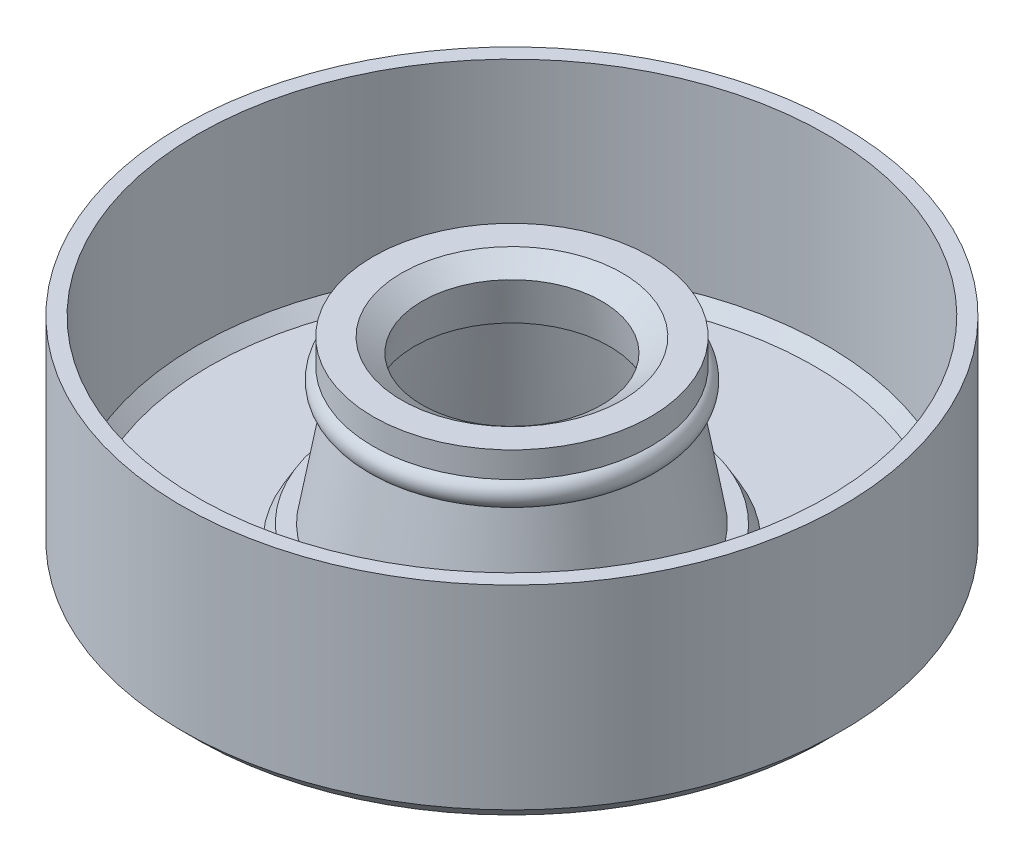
from build123d import *


with BuildPart() as part:
    # Sketch 1 → Revolve 1 (revolve)
    with BuildSketch(Plane.XY):
        with BuildLine():
            Line((-10.1, 0.5), (-5.873607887, 0.5))
            Line((-5.873607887, 0.5), (-5.584932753, 1))
            Line((-5.584932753, 1), (-5.084932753, 1))
            Line((-5.084932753, 1), (-4.432451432, 4.700405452))
            ThreePointArc((-4.432451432, 4.700405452), (-4.867701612, 5.044870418), (-4.632451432, 5.547619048))
            Line((-4.632451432, 5.547619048), (-4.632451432, 6.404761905))
            Line((-4.632451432, 6.404761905), (-3.680070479, 6.404761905))
            Line((-3.680070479, 6.404761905), (-3, 5.928571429))
            Line((-3, 5.928571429), (-3.251895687, 4.5))
            Line((-3.251895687, 4.5), (-3.960075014, 4.5))
            Line((-3.960075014, 4.5), (-4.753546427, 0))
            Line((-4.753546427, 0), (-10.5, 0))
            Line((-10.5, 0), (-11, 0.5))
            Line((-11, 0.5), (-11, 7))
            Line((-11, 7), (-10.5, 7))
            Line((-10.5, 7), (-10.5, 0.9))
            Line((-10.5, 0.9), (-10.1, 0.5))
        make_face()
    revolve(axis=Axis((0, 5.836193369, 0), (0, -1, 0)))


solid = part.part
